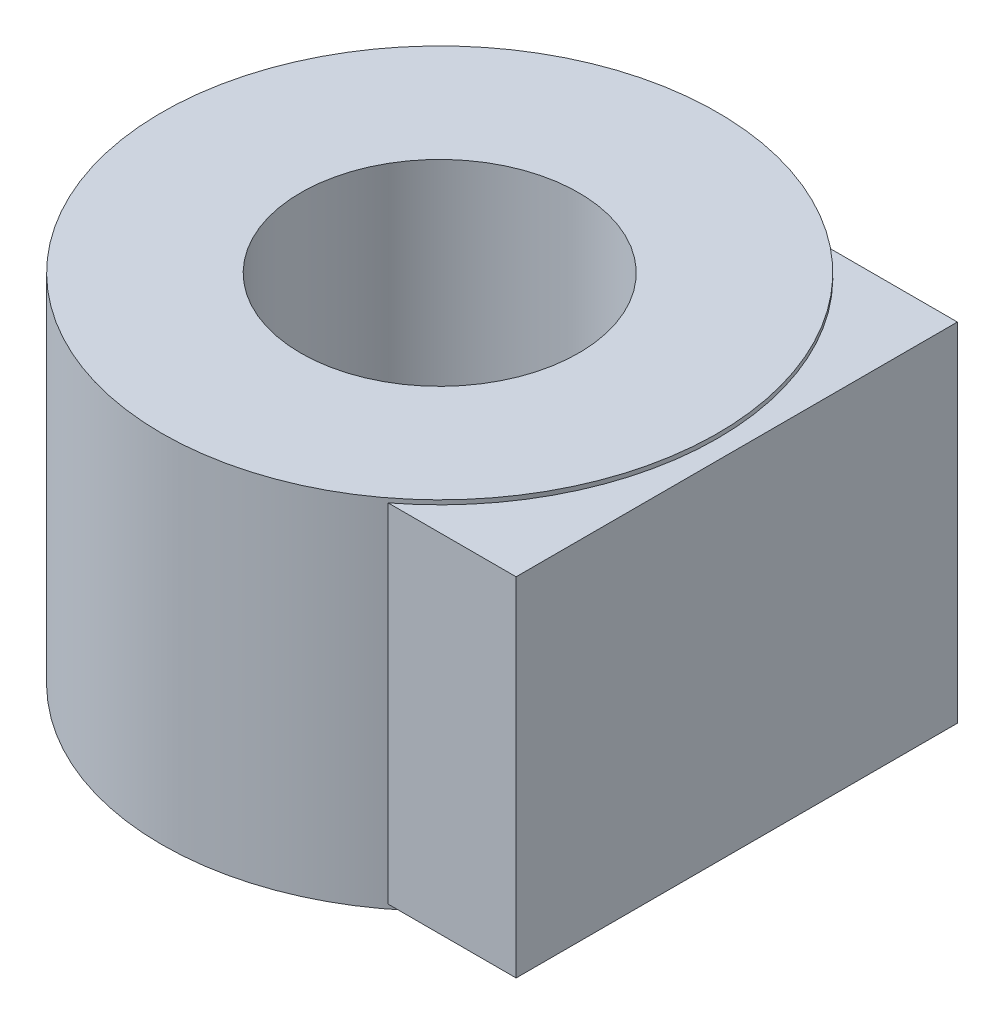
ISO-10303-21;
HEADER;
FILE_DESCRIPTION(('STEP AP214'),'2;1');
FILE_NAME('part.step','',(''),(''),'','','');
FILE_SCHEMA(('AUTOMOTIVE_DESIGN { 1 0 10303 214 1 1 1 1 }'));
ENDSEC;
DATA;
#1=APPLICATION_CONTEXT('core data for automotive mechanical design processes');
#2=APPLICATION_PROTOCOL_DEFINITION('international standard','automotive_design',2000,#1);
#3=PRODUCT_CONTEXT('',#1,'mechanical');
#4=PRODUCT('Part','Part','',(#3));
#5=PRODUCT_RELATED_PRODUCT_CATEGORY('part','',(#4));
#6=PRODUCT_DEFINITION_FORMATION('','',#4);
#7=PRODUCT_DEFINITION_CONTEXT('part definition',#1,'design');
#8=PRODUCT_DEFINITION('design','',#6,#7);
#9=PRODUCT_DEFINITION_SHAPE('','',#8);
#10=(LENGTH_UNIT() NAMED_UNIT(*) SI_UNIT(.MILLI.,.METRE.));
#11=(NAMED_UNIT(*) PLANE_ANGLE_UNIT() SI_UNIT($,.RADIAN.));
#12=(NAMED_UNIT(*) SI_UNIT($,.STERADIAN.) SOLID_ANGLE_UNIT());
#13=UNCERTAINTY_MEASURE_WITH_UNIT(LENGTH_MEASURE(1.E-05),#10,'distance_accuracy_value','');
#14=(GEOMETRIC_REPRESENTATION_CONTEXT(3) GLOBAL_UNCERTAINTY_ASSIGNED_CONTEXT((#13)) GLOBAL_UNIT_ASSIGNED_CONTEXT((#10,
#11,#12)) REPRESENTATION_CONTEXT('',''));
#15=CARTESIAN_POINT('',(0.,0.,0.));
#16=DIRECTION('',(0.,0.,1.));
#17=DIRECTION('',(1.,0.,0.));
#18=AXIS2_PLACEMENT_3D('',#15,#16,#17);
#19=CARTESIAN_POINT('',(-17.0727953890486,4.484375,0.));
#20=DIRECTION('',(0.,-1.,0.));
#21=DIRECTION('',(0.,0.,-1.));
#22=AXIS2_PLACEMENT_3D('',#19,#20,#21);
#23=CYLINDRICAL_SURFACE('',#22,7.);
#24=CARTESIAN_POINT('',(-17.0727953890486,4.484375,0.));
#25=DIRECTION('',(0.,1.,0.));
#26=DIRECTION('',(0.,0.,1.));
#27=AXIS2_PLACEMENT_3D('',#24,#25,#26);
#28=CIRCLE('',#27,7.);
#29=CARTESIAN_POINT('',(-17.0727953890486,4.484375,7.));
#30=VERTEX_POINT('',#29);
#31=EDGE_CURVE('E122',#30,#30,#28,.T.);
#32=ORIENTED_EDGE('',*,*,#31,.F.);
#33=EDGE_LOOP('',(#32));
#34=FACE_BOUND('',#33,.T.);
#35=CARTESIAN_POINT('',(-17.0727953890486,-4.484375,0.));
#36=DIRECTION('',(0.,1.,0.));
#37=DIRECTION('',(0.,0.,1.));
#38=AXIS2_PLACEMENT_3D('',#35,#36,#37);
#39=CIRCLE('',#38,7.);
#40=CARTESIAN_POINT('',(-17.0727953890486,-4.484375,7.));
#41=VERTEX_POINT('',#40);
#42=EDGE_CURVE('E117',#41,#41,#39,.T.);
#43=ORIENTED_EDGE('',*,*,#42,.T.);
#44=EDGE_LOOP('',(#43));
#45=FACE_BOUND('',#44,.T.);
#46=CARTESIAN_POINT('',(-17.0727953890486,-4.375,0.));
#47=DIRECTION('',(0.,1.,0.));
#48=DIRECTION('',(0.,0.,1.));
#49=AXIS2_PLACEMENT_3D('',#46,#47,#48);
#50=CIRCLE('',#49,7.);
#51=CARTESIAN_POINT('',(-12.8150863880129,-4.375,-5.55625));
#52=VERTEX_POINT('',#51);
#53=CARTESIAN_POINT('',(-12.8150863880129,-4.375,5.55625));
#54=VERTEX_POINT('',#53);
#55=EDGE_CURVE('E131',#52,#54,#50,.F.);
#56=ORIENTED_EDGE('',*,*,#55,.T.);
#57=DIRECTION('',(0.,-1.,0.));
#58=VECTOR('',#57,1.);
#59=CARTESIAN_POINT('',(-12.8150863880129,4.484375,5.55625));
#60=LINE('',#59,#58);
#61=CARTESIAN_POINT('',(-12.8150863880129,4.375,5.55625));
#62=VERTEX_POINT('',#61);
#63=EDGE_CURVE('E105',#54,#62,#60,.F.);
#64=ORIENTED_EDGE('',*,*,#63,.T.);
#65=CARTESIAN_POINT('',(-17.0727953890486,4.375,0.));
#66=DIRECTION('',(0.,-1.,0.));
#67=DIRECTION('',(0.,0.,-1.));
#68=AXIS2_PLACEMENT_3D('',#65,#66,#67);
#69=CIRCLE('',#68,7.);
#70=CARTESIAN_POINT('',(-12.8150863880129,4.375,-5.55625));
#71=VERTEX_POINT('',#70);
#72=EDGE_CURVE('E109',#62,#71,#69,.F.);
#73=ORIENTED_EDGE('',*,*,#72,.T.);
#74=DIRECTION('',(0.,-1.,0.));
#75=VECTOR('',#74,1.);
#76=CARTESIAN_POINT('',(-12.8150863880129,4.484375,-5.55625));
#77=LINE('',#76,#75);
#78=EDGE_CURVE('E60',#52,#71,#77,.F.);
#79=ORIENTED_EDGE('',*,*,#78,.F.);
#80=EDGE_LOOP('',(#56,#64,#73,#79));
#81=FACE_BOUND('',#80,.T.);
#82=ADVANCED_FACE('F52',(#34,#45,#81),#23,.T.);
#83=CARTESIAN_POINT('',(-17.0727953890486,4.484375,0.));
#84=DIRECTION('',(0.,1.,0.));
#85=DIRECTION('',(0.,0.,1.));
#86=AXIS2_PLACEMENT_3D('',#83,#84,#85);
#87=PLANE('',#86);
#88=CARTESIAN_POINT('',(-17.0727953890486,4.484375,0.));
#89=DIRECTION('',(0.,1.,0.));
#90=DIRECTION('',(0.,0.,1.));
#91=AXIS2_PLACEMENT_3D('',#88,#89,#90);
#92=CIRCLE('',#91,3.5);
#93=CARTESIAN_POINT('',(-17.0727953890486,4.484375,3.5));
#94=VERTEX_POINT('',#93);
#95=EDGE_CURVE('E118',#94,#94,#92,.T.);
#96=ORIENTED_EDGE('',*,*,#95,.F.);
#97=EDGE_LOOP('',(#96));
#98=FACE_BOUND('',#97,.T.);
#99=ORIENTED_EDGE('',*,*,#31,.T.);
#100=EDGE_LOOP('',(#99));
#101=FACE_BOUND('',#100,.T.);
#102=ADVANCED_FACE('F144',(#98,#101),#87,.T.);
#103=CARTESIAN_POINT('',(-17.0727953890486,-4.484375,0.));
#104=DIRECTION('',(0.,1.,0.));
#105=DIRECTION('',(0.,0.,1.));
#106=AXIS2_PLACEMENT_3D('',#103,#104,#105);
#107=PLANE('',#106);
#108=CARTESIAN_POINT('',(-17.0727953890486,-4.484375,0.));
#109=DIRECTION('',(0.,1.,0.));
#110=DIRECTION('',(0.,0.,1.));
#111=AXIS2_PLACEMENT_3D('',#108,#109,#110);
#112=CIRCLE('',#111,3.5);
#113=CARTESIAN_POINT('',(-17.0727953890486,-4.484375,3.5));
#114=VERTEX_POINT('',#113);
#115=EDGE_CURVE('E115',#114,#114,#112,.T.);
#116=ORIENTED_EDGE('',*,*,#115,.T.);
#117=EDGE_LOOP('',(#116));
#118=FACE_BOUND('',#117,.T.);
#119=ORIENTED_EDGE('',*,*,#42,.F.);
#120=EDGE_LOOP('',(#119));
#121=FACE_BOUND('',#120,.T.);
#122=ADVANCED_FACE('F150',(#118,#121),#107,.F.);
#123=CARTESIAN_POINT('',(-9.19779538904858,0.,5.55625));
#124=DIRECTION('',(0.,0.,-1.));
#125=DIRECTION('',(-1.,0.,0.));
#126=AXIS2_PLACEMENT_3D('',#123,#124,#125);
#127=PLANE('',#126);
#128=DIRECTION('',(1.,0.,0.));
#129=VECTOR('',#128,1.);
#130=CARTESIAN_POINT('',(-17.0727953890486,-4.375,5.55625));
#131=LINE('',#130,#129);
#132=CARTESIAN_POINT('',(-9.59242610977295,-4.375,5.55625));
#133=VERTEX_POINT('',#132);
#134=EDGE_CURVE('E112',#54,#133,#131,.T.);
#135=ORIENTED_EDGE('',*,*,#134,.T.);
#136=DIRECTION('',(0.,1.,0.));
#137=VECTOR('',#136,1.);
#138=CARTESIAN_POINT('',(-9.59242610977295,-4.484375,5.55625));
#139=LINE('',#138,#137);
#140=CARTESIAN_POINT('',(-9.59242610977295,4.375,5.55625));
#141=VERTEX_POINT('',#140);
#142=EDGE_CURVE('E67',#133,#141,#139,.T.);
#143=ORIENTED_EDGE('',*,*,#142,.T.);
#144=DIRECTION('',(-1.,0.,0.));
#145=VECTOR('',#144,1.);
#146=CARTESIAN_POINT('',(-17.0727953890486,4.375,5.55625));
#147=LINE('',#146,#145);
#148=EDGE_CURVE('E100',#141,#62,#147,.T.);
#149=ORIENTED_EDGE('',*,*,#148,.T.);
#150=ORIENTED_EDGE('',*,*,#63,.F.);
#151=EDGE_LOOP('',(#135,#143,#149,#150));
#152=FACE_BOUND('',#151,.T.);
#153=ADVANCED_FACE('F138',(#152),#127,.F.);
#154=CARTESIAN_POINT('',(-9.19779538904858,0.,-5.55625));
#155=DIRECTION('',(0.,0.,-1.));
#156=DIRECTION('',(-1.,0.,0.));
#157=AXIS2_PLACEMENT_3D('',#154,#155,#156);
#158=PLANE('',#157);
#159=DIRECTION('',(0.,1.,0.));
#160=VECTOR('',#159,1.);
#161=CARTESIAN_POINT('',(-9.59242610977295,-4.484375,-5.55625));
#162=LINE('',#161,#160);
#163=CARTESIAN_POINT('',(-9.59242610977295,-4.375,-5.55625));
#164=VERTEX_POINT('',#163);
#165=CARTESIAN_POINT('',(-9.59242610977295,4.375,-5.55625));
#166=VERTEX_POINT('',#165);
#167=EDGE_CURVE('E92',#164,#166,#162,.T.);
#168=ORIENTED_EDGE('',*,*,#167,.F.);
#169=DIRECTION('',(1.,0.,0.));
#170=VECTOR('',#169,1.);
#171=CARTESIAN_POINT('',(-17.0727953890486,-4.375,-5.55625));
#172=LINE('',#171,#170);
#173=EDGE_CURVE('E104',#52,#164,#172,.T.);
#174=ORIENTED_EDGE('',*,*,#173,.F.);
#175=ORIENTED_EDGE('',*,*,#78,.T.);
#176=DIRECTION('',(-1.,0.,0.));
#177=VECTOR('',#176,1.);
#178=CARTESIAN_POINT('',(-17.0727953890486,4.375,-5.55625));
#179=LINE('',#178,#177);
#180=EDGE_CURVE('E74',#166,#71,#179,.T.);
#181=ORIENTED_EDGE('',*,*,#180,.F.);
#182=EDGE_LOOP('',(#168,#174,#175,#181));
#183=FACE_BOUND('',#182,.T.);
#184=ADVANCED_FACE('F103',(#183),#158,.T.);
#185=CARTESIAN_POINT('',(-17.0727953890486,4.375,5.55625));
#186=DIRECTION('',(0.,-1.,0.));
#187=DIRECTION('',(0.,0.,-1.));
#188=AXIS2_PLACEMENT_3D('',#185,#186,#187);
#189=PLANE('',#188);
#190=ORIENTED_EDGE('',*,*,#148,.F.);
#191=DIRECTION('',(0.,0.,1.));
#192=VECTOR('',#191,1.);
#193=CARTESIAN_POINT('',(-9.59242610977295,4.375,-5.55625));
#194=LINE('',#193,#192);
#195=EDGE_CURVE('E94',#166,#141,#194,.T.);
#196=ORIENTED_EDGE('',*,*,#195,.F.);
#197=ORIENTED_EDGE('',*,*,#180,.T.);
#198=ORIENTED_EDGE('',*,*,#72,.F.);
#199=EDGE_LOOP('',(#190,#196,#197,#198));
#200=FACE_BOUND('',#199,.T.);
#201=ADVANCED_FACE('F54',(#200),#189,.F.);
#202=CARTESIAN_POINT('',(-17.0727953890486,-4.375,5.55625));
#203=DIRECTION('',(0.,1.,0.));
#204=DIRECTION('',(0.,0.,1.));
#205=AXIS2_PLACEMENT_3D('',#202,#203,#204);
#206=PLANE('',#205);
#207=ORIENTED_EDGE('',*,*,#173,.T.);
#208=DIRECTION('',(0.,0.,1.));
#209=VECTOR('',#208,1.);
#210=CARTESIAN_POINT('',(-9.59242610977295,-4.375,5.55625));
#211=LINE('',#210,#209);
#212=EDGE_CURVE('E12',#164,#133,#211,.T.);
#213=ORIENTED_EDGE('',*,*,#212,.T.);
#214=ORIENTED_EDGE('',*,*,#134,.F.);
#215=ORIENTED_EDGE('',*,*,#55,.F.);
#216=EDGE_LOOP('',(#207,#213,#214,#215));
#217=FACE_BOUND('',#216,.T.);
#218=ADVANCED_FACE('F141',(#217),#206,.F.);
#219=CARTESIAN_POINT('',(-17.0727953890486,-9.953125,0.));
#220=DIRECTION('',(0.,1.,0.));
#221=DIRECTION('',(0.,0.,1.));
#222=AXIS2_PLACEMENT_3D('',#219,#220,#221);
#223=CYLINDRICAL_SURFACE('',#222,3.5);
#224=ORIENTED_EDGE('',*,*,#95,.T.);
#225=EDGE_LOOP('',(#224));
#226=FACE_BOUND('',#225,.T.);
#227=ORIENTED_EDGE('',*,*,#115,.F.);
#228=EDGE_LOOP('',(#227));
#229=FACE_BOUND('',#228,.T.);
#230=ADVANCED_FACE('F161',(#226,#229),#223,.F.);
#231=CARTESIAN_POINT('',(-9.59242610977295,-4.484375,-5.55625));
#232=DIRECTION('',(-1.,0.,0.));
#233=DIRECTION('',(0.,0.,1.));
#234=AXIS2_PLACEMENT_3D('',#231,#232,#233);
#235=PLANE('',#234);
#236=ORIENTED_EDGE('',*,*,#167,.T.);
#237=ORIENTED_EDGE('',*,*,#195,.T.);
#238=ORIENTED_EDGE('',*,*,#142,.F.);
#239=ORIENTED_EDGE('',*,*,#212,.F.);
#240=EDGE_LOOP('',(#236,#237,#238,#239));
#241=FACE_BOUND('',#240,.T.);
#242=ADVANCED_FACE('F93',(#241),#235,.F.);
#243=CLOSED_SHELL('',(#82,#102,#122,#153,#184,#201,#218,#230,#242));
#244=MANIFOLD_SOLID_BREP('B2',#243);
#245=ADVANCED_BREP_SHAPE_REPRESENTATION('',(#18,#244),#14);
#246=SHAPE_DEFINITION_REPRESENTATION(#9,#245);
ENDSEC;
END-ISO-10303-21;
